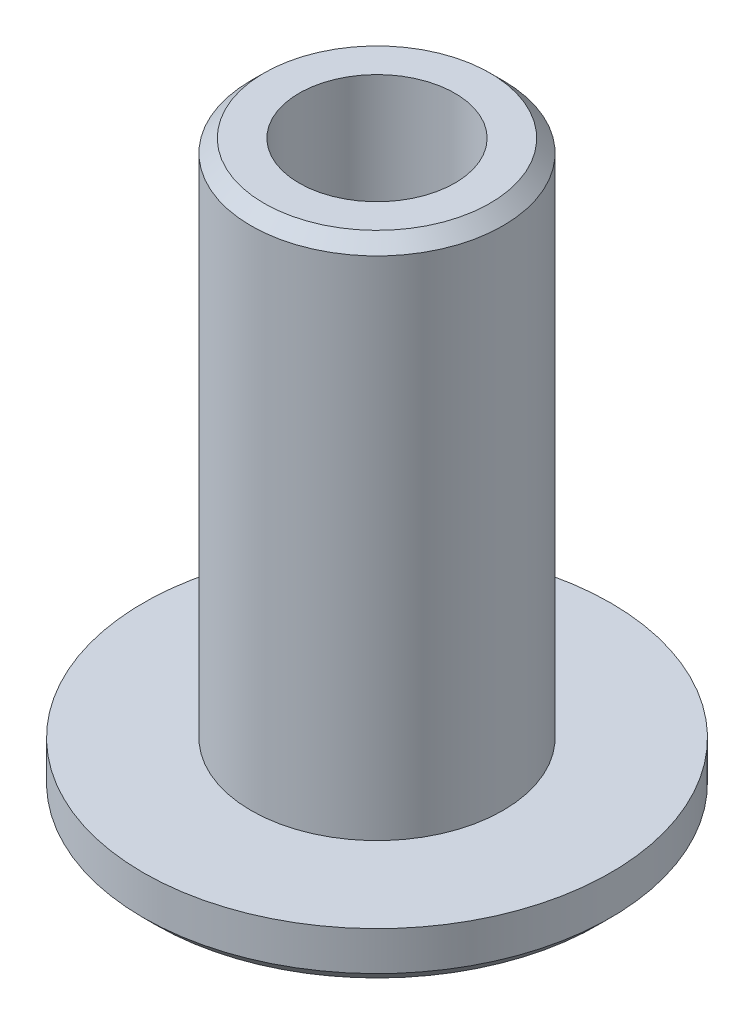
ISO-10303-21;
HEADER;
FILE_DESCRIPTION(('STEP AP214'),'2;1');
FILE_NAME('part.step','',(''),(''),'','','');
FILE_SCHEMA(('AUTOMOTIVE_DESIGN { 1 0 10303 214 1 1 1 1 }'));
ENDSEC;
DATA;
#1=APPLICATION_CONTEXT('core data for automotive mechanical design processes');
#2=APPLICATION_PROTOCOL_DEFINITION('international standard','automotive_design',2000,#1);
#3=PRODUCT_CONTEXT('',#1,'mechanical');
#4=PRODUCT('Part','Part','',(#3));
#5=PRODUCT_RELATED_PRODUCT_CATEGORY('part','',(#4));
#6=PRODUCT_DEFINITION_FORMATION('','',#4);
#7=PRODUCT_DEFINITION_CONTEXT('part definition',#1,'design');
#8=PRODUCT_DEFINITION('design','',#6,#7);
#9=PRODUCT_DEFINITION_SHAPE('','',#8);
#10=(LENGTH_UNIT() NAMED_UNIT(*) SI_UNIT(.MILLI.,.METRE.));
#11=(NAMED_UNIT(*) PLANE_ANGLE_UNIT() SI_UNIT($,.RADIAN.));
#12=(NAMED_UNIT(*) SI_UNIT($,.STERADIAN.) SOLID_ANGLE_UNIT());
#13=UNCERTAINTY_MEASURE_WITH_UNIT(LENGTH_MEASURE(1.E-05),#10,'distance_accuracy_value','');
#14=(GEOMETRIC_REPRESENTATION_CONTEXT(3) GLOBAL_UNCERTAINTY_ASSIGNED_CONTEXT((#13)) GLOBAL_UNIT_ASSIGNED_CONTEXT((#10,
#11,#12)) REPRESENTATION_CONTEXT('',''));
#15=CARTESIAN_POINT('',(0.,0.,0.));
#16=DIRECTION('',(0.,0.,1.));
#17=DIRECTION('',(1.,0.,0.));
#18=AXIS2_PLACEMENT_3D('',#15,#16,#17);
#19=CARTESIAN_POINT('',(0.,2.,0.));
#20=DIRECTION('',(0.,1.,0.));
#21=DIRECTION('',(0.,0.,1.));
#22=AXIS2_PLACEMENT_3D('',#19,#20,#21);
#23=PLANE('',#22);
#24=CARTESIAN_POINT('',(0.,2.,0.));
#25=DIRECTION('',(0.,1.,0.));
#26=DIRECTION('',(0.,0.,1.));
#27=AXIS2_PLACEMENT_3D('',#24,#25,#26);
#28=CIRCLE('',#27,9.);
#29=CARTESIAN_POINT('',(0.,2.,9.));
#30=VERTEX_POINT('',#29);
#31=EDGE_CURVE('E64',#30,#30,#28,.T.);
#32=ORIENTED_EDGE('',*,*,#31,.T.);
#33=EDGE_LOOP('',(#32));
#34=FACE_BOUND('',#33,.T.);
#35=CARTESIAN_POINT('',(0.,2.,0.));
#36=DIRECTION('',(0.,1.,0.));
#37=DIRECTION('',(0.,0.,1.));
#38=AXIS2_PLACEMENT_3D('',#35,#36,#37);
#39=CIRCLE('',#38,4.85);
#40=CARTESIAN_POINT('',(0.,2.,4.85));
#41=VERTEX_POINT('',#40);
#42=EDGE_CURVE('E72',#41,#41,#39,.T.);
#43=ORIENTED_EDGE('',*,*,#42,.F.);
#44=EDGE_LOOP('',(#43));
#45=FACE_BOUND('',#44,.T.);
#46=ADVANCED_FACE('F39',(#34,#45),#23,.T.);
#47=CARTESIAN_POINT('',(0.,0.,0.));
#48=DIRECTION('',(0.,1.,0.));
#49=DIRECTION('',(0.,0.,1.));
#50=AXIS2_PLACEMENT_3D('',#47,#48,#49);
#51=PLANE('',#50);
#52=CARTESIAN_POINT('',(0.,0.,0.));
#53=DIRECTION('',(0.,1.,0.));
#54=DIRECTION('',(0.,0.,1.));
#55=AXIS2_PLACEMENT_3D('',#52,#53,#54);
#56=CIRCLE('',#55,8.49999999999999);
#57=CARTESIAN_POINT('',(0.,0.,8.49999999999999));
#58=VERTEX_POINT('',#57);
#59=EDGE_CURVE('E53',#58,#58,#56,.F.);
#60=ORIENTED_EDGE('',*,*,#59,.T.);
#61=EDGE_LOOP('',(#60));
#62=FACE_BOUND('',#61,.T.);
#63=CARTESIAN_POINT('',(0.,0.,0.));
#64=DIRECTION('',(0.,1.,0.));
#65=DIRECTION('',(0.,0.,1.));
#66=AXIS2_PLACEMENT_3D('',#63,#64,#65);
#67=CIRCLE('',#66,3.);
#68=CARTESIAN_POINT('',(0.,0.,3.));
#69=VERTEX_POINT('',#68);
#70=EDGE_CURVE('E68',#69,#69,#67,.T.);
#71=ORIENTED_EDGE('',*,*,#70,.T.);
#72=EDGE_LOOP('',(#71));
#73=FACE_BOUND('',#72,.T.);
#74=ADVANCED_FACE('F97',(#62,#73),#51,.F.);
#75=CARTESIAN_POINT('',(0.,2.,0.));
#76=DIRECTION('',(0.,-1.,0.));
#77=DIRECTION('',(0.,0.,-1.));
#78=AXIS2_PLACEMENT_3D('',#75,#76,#77);
#79=CYLINDRICAL_SURFACE('',#78,9.);
#80=CARTESIAN_POINT('',(0.,0.500000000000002,0.));
#81=DIRECTION('',(0.,1.,0.));
#82=DIRECTION('',(0.,0.,1.));
#83=AXIS2_PLACEMENT_3D('',#80,#81,#82);
#84=CIRCLE('',#83,9.);
#85=CARTESIAN_POINT('',(0.,0.500000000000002,9.));
#86=VERTEX_POINT('',#85);
#87=EDGE_CURVE('E58',#86,#86,#84,.T.);
#88=ORIENTED_EDGE('',*,*,#87,.T.);
#89=EDGE_LOOP('',(#88));
#90=FACE_BOUND('',#89,.T.);
#91=ORIENTED_EDGE('',*,*,#31,.F.);
#92=EDGE_LOOP('',(#91));
#93=FACE_BOUND('',#92,.T.);
#94=ADVANCED_FACE('F93',(#90,#93),#79,.T.);
#95=CARTESIAN_POINT('',(0.,2.,0.));
#96=DIRECTION('',(0.,-1.,0.));
#97=DIRECTION('',(0.,0.,-1.));
#98=AXIS2_PLACEMENT_3D('',#95,#96,#97);
#99=CYLINDRICAL_SURFACE('',#98,3.);
#100=ORIENTED_EDGE('',*,*,#70,.F.);
#101=EDGE_LOOP('',(#100));
#102=FACE_BOUND('',#101,.T.);
#103=CARTESIAN_POINT('',(0.,22.,0.));
#104=DIRECTION('',(0.,1.,0.));
#105=DIRECTION('',(0.,0.,1.));
#106=AXIS2_PLACEMENT_3D('',#103,#104,#105);
#107=CIRCLE('',#106,3.);
#108=CARTESIAN_POINT('',(0.,22.,3.));
#109=VERTEX_POINT('',#108);
#110=EDGE_CURVE('E76',#109,#109,#107,.T.);
#111=ORIENTED_EDGE('',*,*,#110,.T.);
#112=EDGE_LOOP('',(#111));
#113=FACE_BOUND('',#112,.T.);
#114=ADVANCED_FACE('F81',(#102,#113),#99,.F.);
#115=CARTESIAN_POINT('',(0.,22.,0.));
#116=DIRECTION('',(0.,1.,0.));
#117=DIRECTION('',(0.,0.,1.));
#118=AXIS2_PLACEMENT_3D('',#115,#116,#117);
#119=PLANE('',#118);
#120=CARTESIAN_POINT('',(0.,22.,0.));
#121=DIRECTION('',(0.,1.,0.));
#122=DIRECTION('',(0.,0.,1.));
#123=AXIS2_PLACEMENT_3D('',#120,#121,#122);
#124=CIRCLE('',#123,4.35);
#125=CARTESIAN_POINT('',(0.,22.,4.35));
#126=VERTEX_POINT('',#125);
#127=EDGE_CURVE('E48',#126,#126,#124,.T.);
#128=ORIENTED_EDGE('',*,*,#127,.T.);
#129=EDGE_LOOP('',(#128));
#130=FACE_BOUND('',#129,.T.);
#131=ORIENTED_EDGE('',*,*,#110,.F.);
#132=EDGE_LOOP('',(#131));
#133=FACE_BOUND('',#132,.T.);
#134=ADVANCED_FACE('F83',(#130,#133),#119,.T.);
#135=CARTESIAN_POINT('',(0.,22.,0.));
#136=DIRECTION('',(0.,-1.,0.));
#137=DIRECTION('',(0.,0.,-1.));
#138=AXIS2_PLACEMENT_3D('',#135,#136,#137);
#139=CYLINDRICAL_SURFACE('',#138,4.85);
#140=CARTESIAN_POINT('',(0.,21.5,0.));
#141=DIRECTION('',(0.,1.,0.));
#142=DIRECTION('',(0.,0.,1.));
#143=AXIS2_PLACEMENT_3D('',#140,#141,#142);
#144=CIRCLE('',#143,4.85);
#145=CARTESIAN_POINT('',(0.,21.5,4.85));
#146=VERTEX_POINT('',#145);
#147=EDGE_CURVE('E10',#146,#146,#144,.F.);
#148=ORIENTED_EDGE('',*,*,#147,.T.);
#149=EDGE_LOOP('',(#148));
#150=FACE_BOUND('',#149,.T.);
#151=ORIENTED_EDGE('',*,*,#42,.T.);
#152=EDGE_LOOP('',(#151));
#153=FACE_BOUND('',#152,.T.);
#154=ADVANCED_FACE('F85',(#150,#153),#139,.T.);
#155=CARTESIAN_POINT('',(0.,0.500000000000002,0.));
#156=DIRECTION('',(0.,1.,0.));
#157=DIRECTION('',(0.,0.,1.));
#158=AXIS2_PLACEMENT_3D('',#155,#156,#157);
#159=CONICAL_SURFACE('',#158,9.,0.785398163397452);
#160=ORIENTED_EDGE('',*,*,#59,.F.);
#161=EDGE_LOOP('',(#160));
#162=FACE_BOUND('',#161,.T.);
#163=ORIENTED_EDGE('',*,*,#87,.F.);
#164=EDGE_LOOP('',(#163));
#165=FACE_BOUND('',#164,.T.);
#166=ADVANCED_FACE('F91',(#162,#165),#159,.T.);
#167=CARTESIAN_POINT('',(0.,22.,0.));
#168=DIRECTION('',(0.,-1.,0.));
#169=DIRECTION('',(0.,0.,-1.));
#170=AXIS2_PLACEMENT_3D('',#167,#168,#169);
#171=CONICAL_SURFACE('',#170,4.35,0.785398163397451);
#172=ORIENTED_EDGE('',*,*,#147,.F.);
#173=EDGE_LOOP('',(#172));
#174=FACE_BOUND('',#173,.T.);
#175=ORIENTED_EDGE('',*,*,#127,.F.);
#176=EDGE_LOOP('',(#175));
#177=FACE_BOUND('',#176,.T.);
#178=ADVANCED_FACE('F42',(#174,#177),#171,.T.);
#179=CLOSED_SHELL('',(#46,#74,#94,#114,#134,#154,#166,#178));
#180=MANIFOLD_SOLID_BREP('B2',#179);
#181=ADVANCED_BREP_SHAPE_REPRESENTATION('',(#18,#180),#14);
#182=SHAPE_DEFINITION_REPRESENTATION(#9,#181);
ENDSEC;
END-ISO-10303-21;
